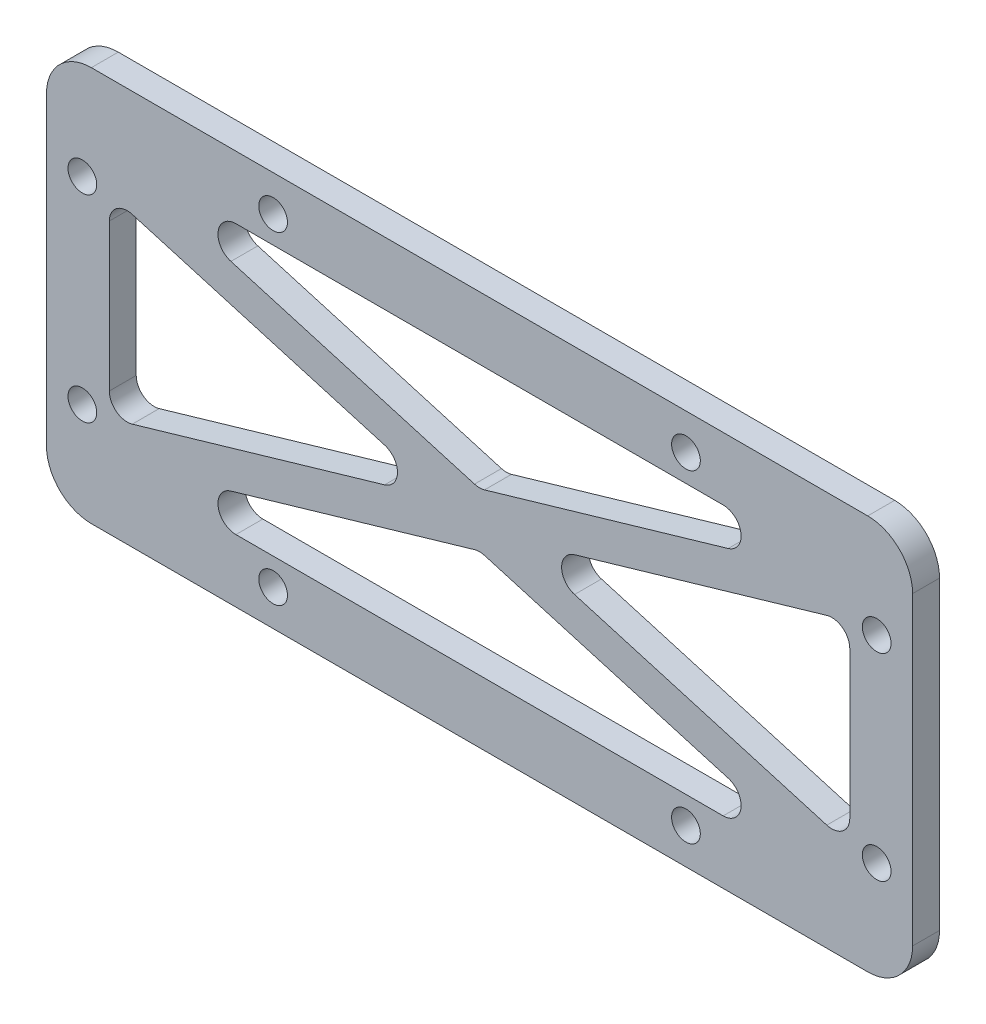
from build123d import *

# Parameters (mm, degrees)
SKETCH_1_W          = 96.501554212
SKETCH_1_H          = 44
EXTRUDE_1_DEPTH     = 3
SKETCH_2_R          = 1.6
CUT_EXTRUDE_1_DEPTH = 54.11438121
SKETCH_3_R          = 1.6
CUT_EXTRUDE_2_DEPTH = 54.11438121
FILLET_1_R          = 5
CUT_EXTRUDE_3_DEPTH = 54.11438121
FILLET_2_R          = 2


with BuildPart() as part:
    # Sketch 1 → Extrude 1 (new body)
    with BuildSketch(Plane.XY):
        Rectangle(SKETCH_1_W, SKETCH_1_H)
    extrude(amount=EXTRUDE_1_DEPTH)

    # Sketch 2 → Cut-Extrude 1 (cut, through all)
    with BuildSketch(Plane.XY.offset(3)):
        with Locations((44.250777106, 11)):
            Circle(SKETCH_2_R)
        with Locations((44.250777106, -11)):
            Circle(SKETCH_2_R)
        with Locations((-44.250777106, -11)):
            Circle(SKETCH_2_R)
        with Locations((-44.250777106, 11)):
            Circle(SKETCH_2_R)
    extrude(amount=-CUT_EXTRUDE_1_DEPTH, mode=Mode.SUBTRACT)

    # Sketch 3 → Cut-Extrude 2 (cut, through all)
    with BuildSketch(Plane.XY.offset(3)):
        with Locations((-23, 18)):
            Circle(SKETCH_3_R)
        with Locations((23, 18)):
            Circle(SKETCH_3_R)
        with Locations((23, -18)):
            Circle(SKETCH_3_R)
        with Locations((-23, -18)):
            Circle(SKETCH_3_R)
    extrude(amount=-CUT_EXTRUDE_2_DEPTH, mode=Mode.SUBTRACT)

    # Fillet 1
    fillet_1_edges = [part.edges().sort_by_distance(p)[0] for p in [
        (-48.250777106, -22, 1.5),
        (-48.250777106, 22, 1.5),
        (48.250777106, 22, 1.5),
        (48.250777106, -22, 1.5),
    ]]
    fillet(fillet_1_edges, radius=FILLET_1_R)

    # Sketch 4 → Cut-Extrude 3 (cut, through all)
    with BuildSketch(Plane.XY.offset(3)):
        Polygon((-41.250777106, 10.864809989), (-41.250777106, -10.864809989), (-4, 0), align=None)
        Polygon((-41.142857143, 15), (0, 3), (41.142857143, 15), align=None)
        Polygon((0, -3), (41.142857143, -15), (-41.142857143, -15), align=None)
        Polygon((41.250777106, -10.864809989), (4, 0), (41.250777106, 10.864809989), align=None)
    extrude(amount=-CUT_EXTRUDE_3_DEPTH, mode=Mode.SUBTRACT)

    # Fillet 2
    fillet_2_edges = [part.edges().sort_by_distance(p)[0] for p in [
        (41.250777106, 10.864809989, 1.5),
        (41.250777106, -10.864809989, 1.5),
        (4, 0, 1.5),
        (-41.142857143, 15, 1.5),
        (41.142857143, 15, 1.5),
        (0, 3, 1.5),
        (-41.250777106, 10.864809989, 1.5),
        (-4, 0, 1.5),
        (-41.250777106, -10.864809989, 1.5),
        (-41.142857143, -15, 1.5),
        (0, -3, 1.5),
        (41.142857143, -15, 1.5),
    ]]
    fillet(fillet_2_edges, radius=FILLET_2_R)


solid = part.part
